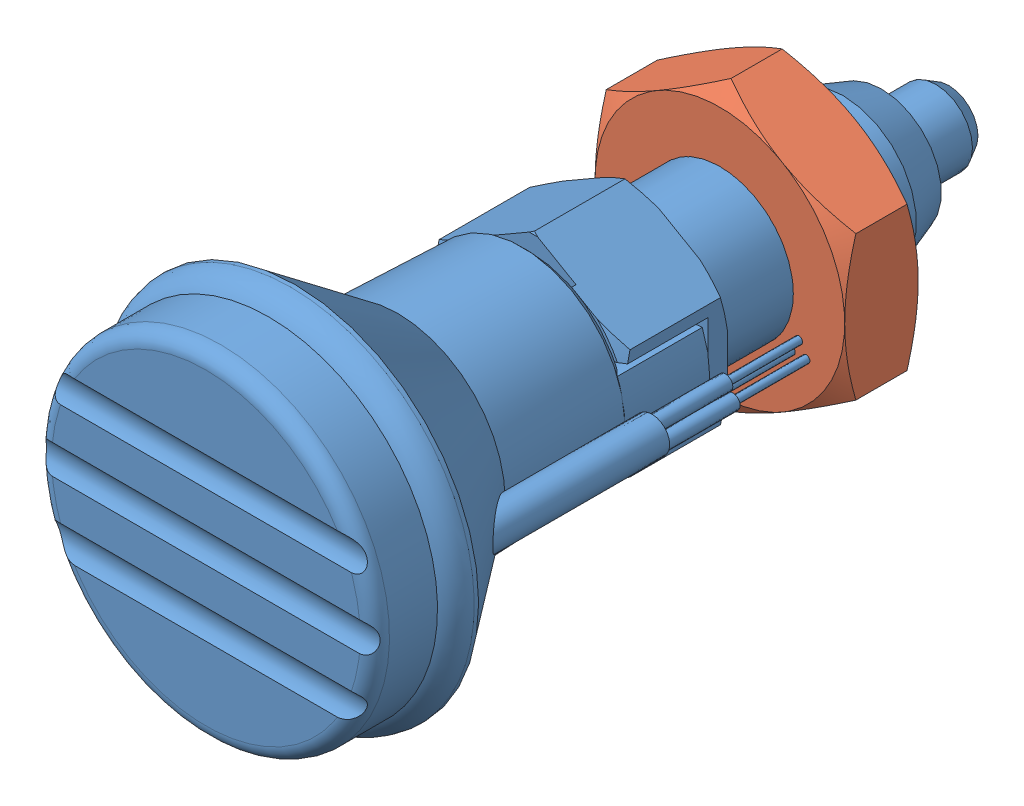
SolidWorks assembly NDX10LW-S-SUS.sldasm, configuration Default (file format 15000). Lengths in mm.
Overall size (25 25 51).
2 component instances, 2 part files, 0 mates.
Components (placement in the parent):
- NDX10LW-S-SUS_01-1: NDX10LW-S-SUS_01.sldprt [ﾃﾞﾌｫﾙﾄ] at origin size (25 25 51)
- NDX10LW-S-SUS_02-1: NDX10LW-S-SUS_02.sldprt [ﾃﾞﾌｫﾙﾄ] at origin size (23.23 23.23 5.01)
